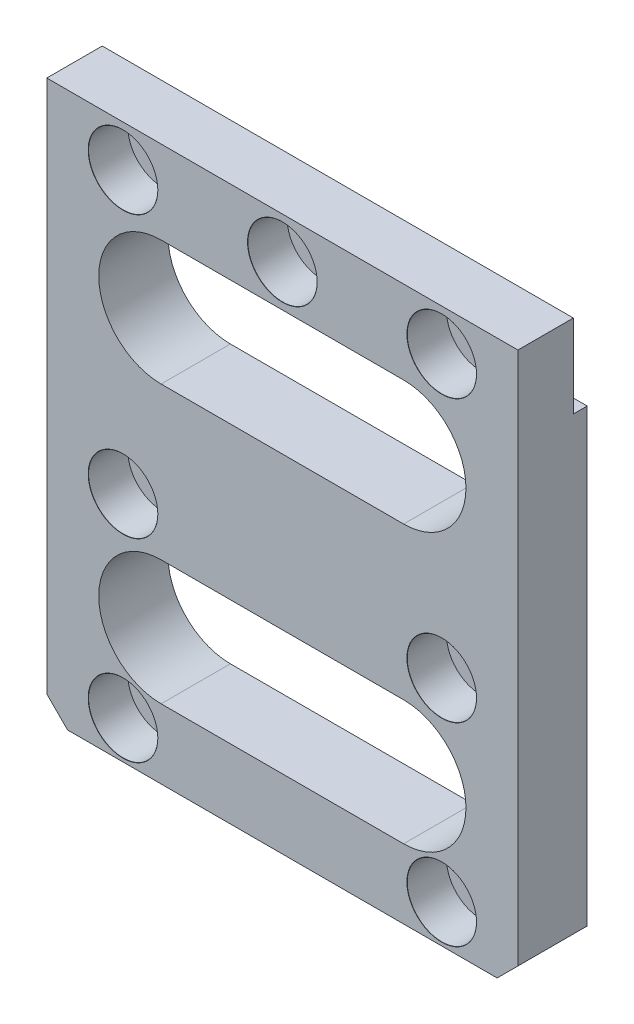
ISO-10303-21;
HEADER;
FILE_DESCRIPTION(('STEP AP214'),'2;1');
FILE_NAME('part.step','',(''),(''),'','','');
FILE_SCHEMA(('AUTOMOTIVE_DESIGN { 1 0 10303 214 1 1 1 1 }'));
ENDSEC;
DATA;
#1=APPLICATION_CONTEXT('core data for automotive mechanical design processes');
#2=APPLICATION_PROTOCOL_DEFINITION('international standard','automotive_design',2000,#1);
#3=PRODUCT_CONTEXT('',#1,'mechanical');
#4=PRODUCT('Part','Part','',(#3));
#5=PRODUCT_RELATED_PRODUCT_CATEGORY('part','',(#4));
#6=PRODUCT_DEFINITION_FORMATION('','',#4);
#7=PRODUCT_DEFINITION_CONTEXT('part definition',#1,'design');
#8=PRODUCT_DEFINITION('design','',#6,#7);
#9=PRODUCT_DEFINITION_SHAPE('','',#8);
#10=(LENGTH_UNIT() NAMED_UNIT(*) SI_UNIT(.MILLI.,.METRE.));
#11=(NAMED_UNIT(*) PLANE_ANGLE_UNIT() SI_UNIT($,.RADIAN.));
#12=(NAMED_UNIT(*) SI_UNIT($,.STERADIAN.) SOLID_ANGLE_UNIT());
#13=UNCERTAINTY_MEASURE_WITH_UNIT(LENGTH_MEASURE(1.E-05),#10,'distance_accuracy_value','');
#14=(GEOMETRIC_REPRESENTATION_CONTEXT(3) GLOBAL_UNCERTAINTY_ASSIGNED_CONTEXT((#13)) GLOBAL_UNIT_ASSIGNED_CONTEXT((#10,
#11,#12)) REPRESENTATION_CONTEXT('',''));
#15=CARTESIAN_POINT('',(0.,0.,0.));
#16=DIRECTION('',(0.,0.,1.));
#17=DIRECTION('',(1.,0.,0.));
#18=AXIS2_PLACEMENT_3D('',#15,#16,#17);
#19=CARTESIAN_POINT('',(0.,0.,10.));
#20=DIRECTION('',(0.,0.,-1.));
#21=DIRECTION('',(-1.,0.,0.));
#22=AXIS2_PLACEMENT_3D('',#19,#20,#21);
#23=PLANE('',#22);
#24=CARTESIAN_POINT('',(-26.6880278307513,-6.,10.));
#25=DIRECTION('',(0.,0.,1.));
#26=DIRECTION('',(1.,0.,0.));
#27=AXIS2_PLACEMENT_3D('',#24,#25,#26);
#28=CIRCLE('',#27,5.025);
#29=CARTESIAN_POINT('',(-21.6630278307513,-6.,10.));
#30=VERTEX_POINT('',#29);
#31=EDGE_CURVE('E420',#30,#30,#28,.T.);
#32=ORIENTED_EDGE('',*,*,#31,.F.);
#33=EDGE_LOOP('',(#32));
#34=FACE_BOUND('',#33,.T.);
#35=CARTESIAN_POINT('',(-3.68802783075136,-6.,10.));
#36=DIRECTION('',(0.,0.,1.));
#37=DIRECTION('',(1.,0.,0.));
#38=AXIS2_PLACEMENT_3D('',#35,#36,#37);
#39=CIRCLE('',#38,5.025);
#40=CARTESIAN_POINT('',(1.33697216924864,-6.,10.));
#41=VERTEX_POINT('',#40);
#42=EDGE_CURVE('E399',#41,#41,#39,.T.);
#43=ORIENTED_EDGE('',*,*,#42,.F.);
#44=EDGE_LOOP('',(#43));
#45=FACE_BOUND('',#44,.T.);
#46=CARTESIAN_POINT('',(-26.6880278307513,-74.5,10.));
#47=DIRECTION('',(0.,0.,1.));
#48=DIRECTION('',(1.,0.,0.));
#49=AXIS2_PLACEMENT_3D('',#46,#47,#48);
#50=CIRCLE('',#49,5.025);
#51=CARTESIAN_POINT('',(-21.6630278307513,-74.5,10.));
#52=VERTEX_POINT('',#51);
#53=EDGE_CURVE('E357',#52,#52,#50,.T.);
#54=ORIENTED_EDGE('',*,*,#53,.F.);
#55=EDGE_LOOP('',(#54));
#56=FACE_BOUND('',#55,.T.);
#57=CARTESIAN_POINT('',(-26.6880278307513,-46.5,10.));
#58=DIRECTION('',(0.,0.,1.));
#59=DIRECTION('',(1.,0.,0.));
#60=AXIS2_PLACEMENT_3D('',#57,#58,#59);
#61=CIRCLE('',#60,5.025);
#62=CARTESIAN_POINT('',(-21.6630278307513,-46.5,10.));
#63=VERTEX_POINT('',#62);
#64=EDGE_CURVE('E336',#63,#63,#61,.T.);
#65=ORIENTED_EDGE('',*,*,#64,.F.);
#66=EDGE_LOOP('',(#65));
#67=FACE_BOUND('',#66,.T.);
#68=CARTESIAN_POINT('',(19.3119721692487,-46.5,10.));
#69=DIRECTION('',(0.,0.,1.));
#70=DIRECTION('',(1.,0.,0.));
#71=AXIS2_PLACEMENT_3D('',#68,#69,#70);
#72=CIRCLE('',#71,5.025);
#73=CARTESIAN_POINT('',(24.3369721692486,-46.5,10.));
#74=VERTEX_POINT('',#73);
#75=EDGE_CURVE('E315',#74,#74,#72,.T.);
#76=ORIENTED_EDGE('',*,*,#75,.F.);
#77=EDGE_LOOP('',(#76));
#78=FACE_BOUND('',#77,.T.);
#79=CARTESIAN_POINT('',(19.3119721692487,-74.5,10.));
#80=DIRECTION('',(0.,0.,1.));
#81=DIRECTION('',(1.,0.,0.));
#82=AXIS2_PLACEMENT_3D('',#79,#80,#81);
#83=CIRCLE('',#82,5.025);
#84=CARTESIAN_POINT('',(24.3369721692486,-74.5,10.));
#85=VERTEX_POINT('',#84);
#86=EDGE_CURVE('E294',#85,#85,#83,.T.);
#87=ORIENTED_EDGE('',*,*,#86,.F.);
#88=EDGE_LOOP('',(#87));
#89=FACE_BOUND('',#88,.T.);
#90=CARTESIAN_POINT('',(-21.1880278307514,-21.,10.));
#91=DIRECTION('',(0.,0.,1.));
#92=DIRECTION('',(1.,0.,0.));
#93=AXIS2_PLACEMENT_3D('',#90,#91,#92);
#94=CIRCLE('',#93,9.);
#95=CARTESIAN_POINT('',(-21.1880278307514,-12.,10.));
#96=VERTEX_POINT('',#95);
#97=CARTESIAN_POINT('',(-21.1880278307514,-30.,10.));
#98=VERTEX_POINT('',#97);
#99=EDGE_CURVE('E224',#96,#98,#94,.T.);
#100=ORIENTED_EDGE('',*,*,#99,.F.);
#101=DIRECTION('',(-1.,0.,0.));
#102=VECTOR('',#101,1.);
#103=CARTESIAN_POINT('',(-21.1880278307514,-12.,10.));
#104=LINE('',#103,#102);
#105=CARTESIAN_POINT('',(13.8119721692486,-12.,10.));
#106=VERTEX_POINT('',#105);
#107=EDGE_CURVE('E232',#106,#96,#104,.T.);
#108=ORIENTED_EDGE('',*,*,#107,.F.);
#109=CARTESIAN_POINT('',(13.8119721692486,-21.,10.));
#110=DIRECTION('',(0.,0.,1.));
#111=DIRECTION('',(1.,0.,0.));
#112=AXIS2_PLACEMENT_3D('',#109,#110,#111);
#113=CIRCLE('',#112,9.);
#114=CARTESIAN_POINT('',(13.8119721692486,-30.,10.));
#115=VERTEX_POINT('',#114);
#116=EDGE_CURVE('E234',#115,#106,#113,.T.);
#117=ORIENTED_EDGE('',*,*,#116,.F.);
#118=DIRECTION('',(1.,0.,0.));
#119=VECTOR('',#118,1.);
#120=CARTESIAN_POINT('',(-21.1880278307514,-30.,10.));
#121=LINE('',#120,#119);
#122=EDGE_CURVE('E237',#98,#115,#121,.T.);
#123=ORIENTED_EDGE('',*,*,#122,.F.);
#124=EDGE_LOOP('',(#100,#108,#117,#123));
#125=FACE_BOUND('',#124,.T.);
#126=DIRECTION('',(0.,-1.,0.));
#127=VECTOR('',#126,1.);
#128=CARTESIAN_POINT('',(-37.6880278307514,0.,10.));
#129=LINE('',#128,#127);
#130=CARTESIAN_POINT('',(-37.6880278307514,0.,10.));
#131=VERTEX_POINT('',#130);
#132=CARTESIAN_POINT('',(-37.6880278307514,-77.,10.));
#133=VERTEX_POINT('',#132);
#134=EDGE_CURVE('E162',#131,#133,#129,.T.);
#135=ORIENTED_EDGE('',*,*,#134,.T.);
#136=DIRECTION('',(-0.707106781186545,0.70710678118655,0.));
#137=VECTOR('',#136,1.);
#138=CARTESIAN_POINT('',(-34.6880278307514,-80.,10.));
#139=LINE('',#138,#137);
#140=CARTESIAN_POINT('',(-34.6880278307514,-80.,10.));
#141=VERTEX_POINT('',#140);
#142=EDGE_CURVE('E24',#133,#141,#139,.F.);
#143=ORIENTED_EDGE('',*,*,#142,.T.);
#144=DIRECTION('',(1.,0.,0.));
#145=VECTOR('',#144,1.);
#146=CARTESIAN_POINT('',(30.3119721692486,-80.,10.));
#147=LINE('',#146,#145);
#148=CARTESIAN_POINT('',(27.3119721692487,-80.,10.));
#149=VERTEX_POINT('',#148);
#150=EDGE_CURVE('E163',#141,#149,#147,.T.);
#151=ORIENTED_EDGE('',*,*,#150,.T.);
#152=DIRECTION('',(-0.707106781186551,-0.707106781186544,0.));
#153=VECTOR('',#152,1.);
#154=CARTESIAN_POINT('',(30.3119721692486,-77.,10.));
#155=LINE('',#154,#153);
#156=CARTESIAN_POINT('',(30.3119721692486,-77.,10.));
#157=VERTEX_POINT('',#156);
#158=EDGE_CURVE('E31',#149,#157,#155,.F.);
#159=ORIENTED_EDGE('',*,*,#158,.T.);
#160=DIRECTION('',(0.,1.,0.));
#161=VECTOR('',#160,1.);
#162=CARTESIAN_POINT('',(30.3119721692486,0.,10.));
#163=LINE('',#162,#161);
#164=CARTESIAN_POINT('',(30.3119721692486,0.,10.));
#165=VERTEX_POINT('',#164);
#166=EDGE_CURVE('E201',#157,#165,#163,.T.);
#167=ORIENTED_EDGE('',*,*,#166,.T.);
#168=DIRECTION('',(-1.,0.,0.));
#169=VECTOR('',#168,1.);
#170=CARTESIAN_POINT('',(30.3119721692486,0.,10.));
#171=LINE('',#170,#169);
#172=EDGE_CURVE('E206',#165,#131,#171,.T.);
#173=ORIENTED_EDGE('',*,*,#172,.T.);
#174=EDGE_LOOP('',(#135,#143,#151,#159,#167,#173));
#175=FACE_BOUND('',#174,.T.);
#176=CARTESIAN_POINT('',(-21.1880278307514,-60.9748393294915,10.));
#177=DIRECTION('',(0.,0.,1.));
#178=DIRECTION('',(1.,0.,0.));
#179=AXIS2_PLACEMENT_3D('',#176,#177,#178);
#180=CIRCLE('',#179,9.);
#181=CARTESIAN_POINT('',(-21.1880278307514,-51.9748393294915,10.));
#182=VERTEX_POINT('',#181);
#183=CARTESIAN_POINT('',(-21.1880278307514,-69.9748393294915,10.));
#184=VERTEX_POINT('',#183);
#185=EDGE_CURVE('E253',#182,#184,#180,.T.);
#186=ORIENTED_EDGE('',*,*,#185,.F.);
#187=DIRECTION('',(-1.,0.,0.));
#188=VECTOR('',#187,1.);
#189=CARTESIAN_POINT('',(-21.1880278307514,-51.9748393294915,10.));
#190=LINE('',#189,#188);
#191=CARTESIAN_POINT('',(13.8119721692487,-51.9748393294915,10.));
#192=VERTEX_POINT('',#191);
#193=EDGE_CURVE('E249',#192,#182,#190,.T.);
#194=ORIENTED_EDGE('',*,*,#193,.F.);
#195=CARTESIAN_POINT('',(13.8119721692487,-60.9748393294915,10.));
#196=DIRECTION('',(0.,0.,1.));
#197=DIRECTION('',(1.,0.,0.));
#198=AXIS2_PLACEMENT_3D('',#195,#196,#197);
#199=CIRCLE('',#198,9.);
#200=CARTESIAN_POINT('',(13.8119721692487,-69.9748393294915,10.));
#201=VERTEX_POINT('',#200);
#202=EDGE_CURVE('E265',#201,#192,#199,.T.);
#203=ORIENTED_EDGE('',*,*,#202,.F.);
#204=DIRECTION('',(1.,0.,0.));
#205=VECTOR('',#204,1.);
#206=CARTESIAN_POINT('',(-21.1880278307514,-69.9748393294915,10.));
#207=LINE('',#206,#205);
#208=EDGE_CURVE('E268',#184,#201,#207,.T.);
#209=ORIENTED_EDGE('',*,*,#208,.F.);
#210=EDGE_LOOP('',(#186,#194,#203,#209));
#211=FACE_BOUND('',#210,.T.);
#212=CARTESIAN_POINT('',(19.3119721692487,-6.,10.));
#213=DIRECTION('',(0.,0.,1.));
#214=DIRECTION('',(1.,0.,0.));
#215=AXIS2_PLACEMENT_3D('',#212,#213,#214);
#216=CIRCLE('',#215,5.025);
#217=CARTESIAN_POINT('',(24.3369721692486,-6.,10.));
#218=VERTEX_POINT('',#217);
#219=EDGE_CURVE('E378',#218,#218,#216,.T.);
#220=ORIENTED_EDGE('',*,*,#219,.F.);
#221=EDGE_LOOP('',(#220));
#222=FACE_BOUND('',#221,.T.);
#223=ADVANCED_FACE('F16',(#34,#45,#56,#67,#78,#89,#125,#175,#211,#222),#23,.F.);
#224=CARTESIAN_POINT('',(0.,0.,0.));
#225=DIRECTION('',(0.,0.,-1.));
#226=DIRECTION('',(-1.,0.,0.));
#227=AXIS2_PLACEMENT_3D('',#224,#225,#226);
#228=PLANE('',#227);
#229=CARTESIAN_POINT('',(-26.6880278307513,-74.5,0.));
#230=DIRECTION('',(0.,0.,1.));
#231=DIRECTION('',(1.,0.,0.));
#232=AXIS2_PLACEMENT_3D('',#229,#230,#231);
#233=CIRCLE('',#232,2.775);
#234=CARTESIAN_POINT('',(-23.9130278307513,-74.5,0.));
#235=VERTEX_POINT('',#234);
#236=EDGE_CURVE('E360',#235,#235,#233,.T.);
#237=ORIENTED_EDGE('',*,*,#236,.T.);
#238=EDGE_LOOP('',(#237));
#239=FACE_BOUND('',#238,.T.);
#240=CARTESIAN_POINT('',(-26.6880278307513,-46.5,0.));
#241=DIRECTION('',(0.,0.,1.));
#242=DIRECTION('',(1.,0.,0.));
#243=AXIS2_PLACEMENT_3D('',#240,#241,#242);
#244=CIRCLE('',#243,2.775);
#245=CARTESIAN_POINT('',(-23.9130278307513,-46.5,0.));
#246=VERTEX_POINT('',#245);
#247=EDGE_CURVE('E339',#246,#246,#244,.T.);
#248=ORIENTED_EDGE('',*,*,#247,.T.);
#249=EDGE_LOOP('',(#248));
#250=FACE_BOUND('',#249,.T.);
#251=CARTESIAN_POINT('',(19.3119721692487,-46.5,0.));
#252=DIRECTION('',(0.,0.,1.));
#253=DIRECTION('',(1.,0.,0.));
#254=AXIS2_PLACEMENT_3D('',#251,#252,#253);
#255=CIRCLE('',#254,2.775);
#256=CARTESIAN_POINT('',(22.0869721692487,-46.5,0.));
#257=VERTEX_POINT('',#256);
#258=EDGE_CURVE('E318',#257,#257,#255,.T.);
#259=ORIENTED_EDGE('',*,*,#258,.T.);
#260=EDGE_LOOP('',(#259));
#261=FACE_BOUND('',#260,.T.);
#262=CARTESIAN_POINT('',(19.3119721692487,-74.5,0.));
#263=DIRECTION('',(0.,0.,1.));
#264=DIRECTION('',(1.,0.,0.));
#265=AXIS2_PLACEMENT_3D('',#262,#263,#264);
#266=CIRCLE('',#265,2.775);
#267=CARTESIAN_POINT('',(22.0869721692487,-74.5,0.));
#268=VERTEX_POINT('',#267);
#269=EDGE_CURVE('E297',#268,#268,#266,.T.);
#270=ORIENTED_EDGE('',*,*,#269,.T.);
#271=EDGE_LOOP('',(#270));
#272=FACE_BOUND('',#271,.T.);
#273=DIRECTION('',(1.,0.,0.));
#274=VECTOR('',#273,1.);
#275=CARTESIAN_POINT('',(30.3119721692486,-80.,0.));
#276=LINE('',#275,#274);
#277=CARTESIAN_POINT('',(-34.6880278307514,-80.,0.));
#278=VERTEX_POINT('',#277);
#279=CARTESIAN_POINT('',(27.3119721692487,-80.,0.));
#280=VERTEX_POINT('',#279);
#281=EDGE_CURVE('E169',#278,#280,#276,.T.);
#282=ORIENTED_EDGE('',*,*,#281,.F.);
#283=DIRECTION('',(0.707106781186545,-0.70710678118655,0.));
#284=VECTOR('',#283,1.);
#285=CARTESIAN_POINT('',(-57.3440139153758,-57.3440139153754,0.));
#286=LINE('',#285,#284);
#287=CARTESIAN_POINT('',(-37.6880278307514,-77.,0.));
#288=VERTEX_POINT('',#287);
#289=EDGE_CURVE('E180',#278,#288,#286,.F.);
#290=ORIENTED_EDGE('',*,*,#289,.T.);
#291=DIRECTION('',(0.,-1.,0.));
#292=VECTOR('',#291,1.);
#293=CARTESIAN_POINT('',(-37.6880278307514,0.,0.));
#294=LINE('',#293,#292);
#295=CARTESIAN_POINT('',(-37.6880278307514,-12.,0.));
#296=VERTEX_POINT('',#295);
#297=EDGE_CURVE('E199',#296,#288,#294,.T.);
#298=ORIENTED_EDGE('',*,*,#297,.F.);
#299=DIRECTION('',(1.,0.,0.));
#300=VECTOR('',#299,1.);
#301=CARTESIAN_POINT('',(-37.6880278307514,-12.,0.));
#302=LINE('',#301,#300);
#303=CARTESIAN_POINT('',(-21.1880278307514,-12.,0.));
#304=VERTEX_POINT('',#303);
#305=EDGE_CURVE('E263',#296,#304,#302,.T.);
#306=ORIENTED_EDGE('',*,*,#305,.T.);
#307=CARTESIAN_POINT('',(-21.1880278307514,-21.,0.));
#308=DIRECTION('',(0.,0.,1.));
#309=DIRECTION('',(1.,0.,0.));
#310=AXIS2_PLACEMENT_3D('',#307,#308,#309);
#311=CIRCLE('',#310,9.);
#312=CARTESIAN_POINT('',(-21.1880278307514,-30.,0.));
#313=VERTEX_POINT('',#312);
#314=EDGE_CURVE('E228',#304,#313,#311,.T.);
#315=ORIENTED_EDGE('',*,*,#314,.T.);
#316=DIRECTION('',(1.,0.,0.));
#317=VECTOR('',#316,1.);
#318=CARTESIAN_POINT('',(-21.1880278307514,-30.,0.));
#319=LINE('',#318,#317);
#320=CARTESIAN_POINT('',(13.8119721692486,-30.,0.));
#321=VERTEX_POINT('',#320);
#322=EDGE_CURVE('E225',#313,#321,#319,.T.);
#323=ORIENTED_EDGE('',*,*,#322,.T.);
#324=CARTESIAN_POINT('',(13.8119721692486,-21.,0.));
#325=DIRECTION('',(0.,0.,1.));
#326=DIRECTION('',(1.,0.,0.));
#327=AXIS2_PLACEMENT_3D('',#324,#325,#326);
#328=CIRCLE('',#327,9.);
#329=CARTESIAN_POINT('',(13.8119721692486,-12.,0.));
#330=VERTEX_POINT('',#329);
#331=EDGE_CURVE('E221',#321,#330,#328,.T.);
#332=ORIENTED_EDGE('',*,*,#331,.T.);
#333=CARTESIAN_POINT('',(30.3119721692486,-12.,0.));
#334=VERTEX_POINT('',#333);
#335=EDGE_CURVE('E272',#330,#334,#302,.T.);
#336=ORIENTED_EDGE('',*,*,#335,.T.);
#337=DIRECTION('',(0.,1.,0.));
#338=VECTOR('',#337,1.);
#339=CARTESIAN_POINT('',(30.3119721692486,0.,0.));
#340=LINE('',#339,#338);
#341=CARTESIAN_POINT('',(30.3119721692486,-77.,0.));
#342=VERTEX_POINT('',#341);
#343=EDGE_CURVE('E200',#342,#334,#340,.T.);
#344=ORIENTED_EDGE('',*,*,#343,.F.);
#345=DIRECTION('',(0.707106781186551,0.707106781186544,0.));
#346=VECTOR('',#345,1.);
#347=CARTESIAN_POINT('',(53.6559860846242,-53.6559860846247,0.));
#348=LINE('',#347,#346);
#349=EDGE_CURVE('E178',#342,#280,#348,.F.);
#350=ORIENTED_EDGE('',*,*,#349,.T.);
#351=EDGE_LOOP('',(#282,#290,#298,#306,#315,#323,#332,#336,#344,#350));
#352=FACE_BOUND('',#351,.T.);
#353=DIRECTION('',(-1.,0.,0.));
#354=VECTOR('',#353,1.);
#355=CARTESIAN_POINT('',(-21.1880278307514,-51.9748393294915,0.));
#356=LINE('',#355,#354);
#357=CARTESIAN_POINT('',(13.8119721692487,-51.9748393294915,0.));
#358=VERTEX_POINT('',#357);
#359=CARTESIAN_POINT('',(-21.1880278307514,-51.9748393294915,0.));
#360=VERTEX_POINT('',#359);
#361=EDGE_CURVE('E250',#358,#360,#356,.T.);
#362=ORIENTED_EDGE('',*,*,#361,.T.);
#363=CARTESIAN_POINT('',(-21.1880278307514,-60.9748393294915,0.));
#364=DIRECTION('',(0.,0.,1.));
#365=DIRECTION('',(1.,0.,0.));
#366=AXIS2_PLACEMENT_3D('',#363,#364,#365);
#367=CIRCLE('',#366,9.);
#368=CARTESIAN_POINT('',(-21.1880278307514,-69.9748393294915,0.));
#369=VERTEX_POINT('',#368);
#370=EDGE_CURVE('E260',#360,#369,#367,.T.);
#371=ORIENTED_EDGE('',*,*,#370,.T.);
#372=DIRECTION('',(1.,0.,0.));
#373=VECTOR('',#372,1.);
#374=CARTESIAN_POINT('',(-21.1880278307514,-69.9748393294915,0.));
#375=LINE('',#374,#373);
#376=CARTESIAN_POINT('',(13.8119721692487,-69.9748393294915,0.));
#377=VERTEX_POINT('',#376);
#378=EDGE_CURVE('E257',#369,#377,#375,.T.);
#379=ORIENTED_EDGE('',*,*,#378,.T.);
#380=CARTESIAN_POINT('',(13.8119721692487,-60.9748393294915,0.));
#381=DIRECTION('',(0.,0.,1.));
#382=DIRECTION('',(1.,0.,0.));
#383=AXIS2_PLACEMENT_3D('',#380,#381,#382);
#384=CIRCLE('',#383,9.);
#385=EDGE_CURVE('E254',#377,#358,#384,.T.);
#386=ORIENTED_EDGE('',*,*,#385,.T.);
#387=EDGE_LOOP('',(#362,#371,#379,#386));
#388=FACE_BOUND('',#387,.T.);
#389=ADVANCED_FACE('F196',(#239,#250,#261,#272,#352,#388),#228,.T.);
#390=CARTESIAN_POINT('',(30.3119721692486,0.,10.));
#391=DIRECTION('',(-1.,0.,0.));
#392=DIRECTION('',(0.,-1.,0.));
#393=AXIS2_PLACEMENT_3D('',#390,#391,#392);
#394=PLANE('',#393);
#395=ORIENTED_EDGE('',*,*,#166,.F.);
#396=DIRECTION('',(0.,0.,-1.));
#397=VECTOR('',#396,1.);
#398=CARTESIAN_POINT('',(30.3119721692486,-77.,10.));
#399=LINE('',#398,#397);
#400=EDGE_CURVE('E11',#157,#342,#399,.T.);
#401=ORIENTED_EDGE('',*,*,#400,.T.);
#402=ORIENTED_EDGE('',*,*,#343,.T.);
#403=DIRECTION('',(0.,0.,-1.));
#404=VECTOR('',#403,1.);
#405=CARTESIAN_POINT('',(30.3119721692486,-12.,0.));
#406=LINE('',#405,#404);
#407=CARTESIAN_POINT('',(30.3119721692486,-12.,2.));
#408=VERTEX_POINT('',#407);
#409=EDGE_CURVE('E149',#408,#334,#406,.T.);
#410=ORIENTED_EDGE('',*,*,#409,.F.);
#411=DIRECTION('',(0.,-1.,0.));
#412=VECTOR('',#411,1.);
#413=CARTESIAN_POINT('',(30.3119721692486,0.,2.));
#414=LINE('',#413,#412);
#415=CARTESIAN_POINT('',(30.3119721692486,0.,2.));
#416=VERTEX_POINT('',#415);
#417=EDGE_CURVE('E276',#416,#408,#414,.T.);
#418=ORIENTED_EDGE('',*,*,#417,.F.);
#419=DIRECTION('',(0.,0.,-1.));
#420=VECTOR('',#419,1.);
#421=CARTESIAN_POINT('',(30.3119721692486,0.,10.));
#422=LINE('',#421,#420);
#423=EDGE_CURVE('E158',#165,#416,#422,.T.);
#424=ORIENTED_EDGE('',*,*,#423,.F.);
#425=EDGE_LOOP('',(#395,#401,#402,#410,#418,#424));
#426=FACE_BOUND('',#425,.T.);
#427=ADVANCED_FACE('F507',(#426),#394,.F.);
#428=CARTESIAN_POINT('',(30.3119721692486,0.,10.));
#429=DIRECTION('',(0.,-1.,0.));
#430=DIRECTION('',(1.,0.,0.));
#431=AXIS2_PLACEMENT_3D('',#428,#429,#430);
#432=PLANE('',#431);
#433=ORIENTED_EDGE('',*,*,#423,.T.);
#434=DIRECTION('',(1.,0.,0.));
#435=VECTOR('',#434,1.);
#436=CARTESIAN_POINT('',(-37.6880278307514,0.,2.));
#437=LINE('',#436,#435);
#438=CARTESIAN_POINT('',(-37.6880278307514,0.,2.));
#439=VERTEX_POINT('',#438);
#440=EDGE_CURVE('E141',#439,#416,#437,.T.);
#441=ORIENTED_EDGE('',*,*,#440,.F.);
#442=DIRECTION('',(0.,0.,-1.));
#443=VECTOR('',#442,1.);
#444=CARTESIAN_POINT('',(-37.6880278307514,0.,10.));
#445=LINE('',#444,#443);
#446=EDGE_CURVE('E156',#131,#439,#445,.T.);
#447=ORIENTED_EDGE('',*,*,#446,.F.);
#448=ORIENTED_EDGE('',*,*,#172,.F.);
#449=EDGE_LOOP('',(#433,#441,#447,#448));
#450=FACE_BOUND('',#449,.T.);
#451=ADVANCED_FACE('F154',(#450),#432,.F.);
#452=CARTESIAN_POINT('',(-37.6880278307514,0.,10.));
#453=DIRECTION('',(1.,0.,0.));
#454=DIRECTION('',(0.,1.,0.));
#455=AXIS2_PLACEMENT_3D('',#452,#453,#454);
#456=PLANE('',#455);
#457=ORIENTED_EDGE('',*,*,#297,.T.);
#458=DIRECTION('',(0.,0.,1.));
#459=VECTOR('',#458,1.);
#460=CARTESIAN_POINT('',(-37.6880278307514,-77.,10.));
#461=LINE('',#460,#459);
#462=EDGE_CURVE('E39',#288,#133,#461,.T.);
#463=ORIENTED_EDGE('',*,*,#462,.T.);
#464=ORIENTED_EDGE('',*,*,#134,.F.);
#465=ORIENTED_EDGE('',*,*,#446,.T.);
#466=DIRECTION('',(0.,-1.,0.));
#467=VECTOR('',#466,1.);
#468=CARTESIAN_POINT('',(-37.6880278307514,0.,2.));
#469=LINE('',#468,#467);
#470=CARTESIAN_POINT('',(-37.6880278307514,-12.,2.));
#471=VERTEX_POINT('',#470);
#472=EDGE_CURVE('E137',#439,#471,#469,.T.);
#473=ORIENTED_EDGE('',*,*,#472,.T.);
#474=DIRECTION('',(0.,0.,-1.));
#475=VECTOR('',#474,1.);
#476=CARTESIAN_POINT('',(-37.6880278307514,-12.,0.));
#477=LINE('',#476,#475);
#478=EDGE_CURVE('E148',#471,#296,#477,.T.);
#479=ORIENTED_EDGE('',*,*,#478,.T.);
#480=EDGE_LOOP('',(#457,#463,#464,#465,#473,#479));
#481=FACE_BOUND('',#480,.T.);
#482=ADVANCED_FACE('F161',(#481),#456,.F.);
#483=CARTESIAN_POINT('',(30.3119721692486,-80.,10.));
#484=DIRECTION('',(0.,1.,0.));
#485=DIRECTION('',(-1.,0.,0.));
#486=AXIS2_PLACEMENT_3D('',#483,#484,#485);
#487=PLANE('',#486);
#488=ORIENTED_EDGE('',*,*,#150,.F.);
#489=DIRECTION('',(0.,0.,-1.));
#490=VECTOR('',#489,1.);
#491=CARTESIAN_POINT('',(-34.6880278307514,-80.,10.));
#492=LINE('',#491,#490);
#493=EDGE_CURVE('E175',#141,#278,#492,.T.);
#494=ORIENTED_EDGE('',*,*,#493,.T.);
#495=ORIENTED_EDGE('',*,*,#281,.T.);
#496=DIRECTION('',(0.,0.,1.));
#497=VECTOR('',#496,1.);
#498=CARTESIAN_POINT('',(27.3119721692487,-80.,10.));
#499=LINE('',#498,#497);
#500=EDGE_CURVE('E173',#280,#149,#499,.T.);
#501=ORIENTED_EDGE('',*,*,#500,.T.);
#502=EDGE_LOOP('',(#488,#494,#495,#501));
#503=FACE_BOUND('',#502,.T.);
#504=ADVANCED_FACE('F189',(#503),#487,.F.);
#505=CARTESIAN_POINT('',(-21.1880278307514,-21.,10.));
#506=DIRECTION('',(0.,0.,-1.));
#507=DIRECTION('',(-1.,0.,0.));
#508=AXIS2_PLACEMENT_3D('',#505,#506,#507);
#509=CYLINDRICAL_SURFACE('',#508,9.);
#510=ORIENTED_EDGE('',*,*,#314,.F.);
#511=DIRECTION('',(0.,0.,-1.));
#512=VECTOR('',#511,1.);
#513=CARTESIAN_POINT('',(-21.1880278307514,-12.,10.));
#514=LINE('',#513,#512);
#515=CARTESIAN_POINT('',(-21.1880278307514,-12.,2.));
#516=VERTEX_POINT('',#515);
#517=EDGE_CURVE('E220',#516,#304,#514,.T.);
#518=ORIENTED_EDGE('',*,*,#517,.F.);
#519=EDGE_CURVE('E217',#96,#516,#514,.T.);
#520=ORIENTED_EDGE('',*,*,#519,.F.);
#521=ORIENTED_EDGE('',*,*,#99,.T.);
#522=DIRECTION('',(0.,0.,-1.));
#523=VECTOR('',#522,1.);
#524=CARTESIAN_POINT('',(-21.1880278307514,-30.,10.));
#525=LINE('',#524,#523);
#526=EDGE_CURVE('E202',#98,#313,#525,.T.);
#527=ORIENTED_EDGE('',*,*,#526,.T.);
#528=EDGE_LOOP('',(#510,#518,#520,#521,#527));
#529=FACE_BOUND('',#528,.T.);
#530=ADVANCED_FACE('F487',(#529),#509,.F.);
#531=CARTESIAN_POINT('',(-21.1880278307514,-30.,10.));
#532=DIRECTION('',(0.,1.,0.));
#533=DIRECTION('',(-1.,0.,0.));
#534=AXIS2_PLACEMENT_3D('',#531,#532,#533);
#535=PLANE('',#534);
#536=ORIENTED_EDGE('',*,*,#322,.F.);
#537=ORIENTED_EDGE('',*,*,#526,.F.);
#538=ORIENTED_EDGE('',*,*,#122,.T.);
#539=DIRECTION('',(0.,0.,-1.));
#540=VECTOR('',#539,1.);
#541=CARTESIAN_POINT('',(13.8119721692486,-30.,10.));
#542=LINE('',#541,#540);
#543=EDGE_CURVE('E211',#115,#321,#542,.T.);
#544=ORIENTED_EDGE('',*,*,#543,.T.);
#545=EDGE_LOOP('',(#536,#537,#538,#544));
#546=FACE_BOUND('',#545,.T.);
#547=ADVANCED_FACE('F490',(#546),#535,.T.);
#548=CARTESIAN_POINT('',(13.8119721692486,-21.,10.));
#549=DIRECTION('',(0.,0.,-1.));
#550=DIRECTION('',(-1.,0.,0.));
#551=AXIS2_PLACEMENT_3D('',#548,#549,#550);
#552=CYLINDRICAL_SURFACE('',#551,9.);
#553=ORIENTED_EDGE('',*,*,#331,.F.);
#554=ORIENTED_EDGE('',*,*,#543,.F.);
#555=ORIENTED_EDGE('',*,*,#116,.T.);
#556=DIRECTION('',(0.,0.,-1.));
#557=VECTOR('',#556,1.);
#558=CARTESIAN_POINT('',(13.8119721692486,-12.,10.));
#559=LINE('',#558,#557);
#560=CARTESIAN_POINT('',(13.8119721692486,-12.,2.));
#561=VERTEX_POINT('',#560);
#562=EDGE_CURVE('E213',#106,#561,#559,.T.);
#563=ORIENTED_EDGE('',*,*,#562,.T.);
#564=EDGE_CURVE('E216',#561,#330,#559,.T.);
#565=ORIENTED_EDGE('',*,*,#564,.T.);
#566=EDGE_LOOP('',(#553,#554,#555,#563,#565));
#567=FACE_BOUND('',#566,.T.);
#568=ADVANCED_FACE('F500',(#567),#552,.F.);
#569=CARTESIAN_POINT('',(-21.1880278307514,-12.,10.));
#570=DIRECTION('',(0.,-1.,0.));
#571=DIRECTION('',(1.,0.,0.));
#572=AXIS2_PLACEMENT_3D('',#569,#570,#571);
#573=PLANE('',#572);
#574=DIRECTION('',(-1.,0.,0.));
#575=VECTOR('',#574,1.);
#576=CARTESIAN_POINT('',(-21.1880278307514,-12.,2.));
#577=LINE('',#576,#575);
#578=EDGE_CURVE('E165',#561,#516,#577,.T.);
#579=ORIENTED_EDGE('',*,*,#578,.F.);
#580=ORIENTED_EDGE('',*,*,#562,.F.);
#581=ORIENTED_EDGE('',*,*,#107,.T.);
#582=ORIENTED_EDGE('',*,*,#519,.T.);
#583=EDGE_LOOP('',(#579,#580,#581,#582));
#584=FACE_BOUND('',#583,.T.);
#585=ADVANCED_FACE('F497',(#584),#573,.T.);
#586=CARTESIAN_POINT('',(-21.1880278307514,-60.9748393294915,10.));
#587=DIRECTION('',(0.,0.,-1.));
#588=DIRECTION('',(-1.,0.,0.));
#589=AXIS2_PLACEMENT_3D('',#586,#587,#588);
#590=CYLINDRICAL_SURFACE('',#589,9.);
#591=ORIENTED_EDGE('',*,*,#370,.F.);
#592=DIRECTION('',(0.,0.,-1.));
#593=VECTOR('',#592,1.);
#594=CARTESIAN_POINT('',(-21.1880278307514,-51.9748393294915,10.));
#595=LINE('',#594,#593);
#596=EDGE_CURVE('E246',#182,#360,#595,.T.);
#597=ORIENTED_EDGE('',*,*,#596,.F.);
#598=ORIENTED_EDGE('',*,*,#185,.T.);
#599=DIRECTION('',(0.,0.,-1.));
#600=VECTOR('',#599,1.);
#601=CARTESIAN_POINT('',(-21.1880278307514,-69.9748393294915,10.));
#602=LINE('',#601,#600);
#603=EDGE_CURVE('E231',#184,#369,#602,.T.);
#604=ORIENTED_EDGE('',*,*,#603,.T.);
#605=EDGE_LOOP('',(#591,#597,#598,#604));
#606=FACE_BOUND('',#605,.T.);
#607=ADVANCED_FACE('F547',(#606),#590,.F.);
#608=CARTESIAN_POINT('',(-21.1880278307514,-69.9748393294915,10.));
#609=DIRECTION('',(0.,1.,0.));
#610=DIRECTION('',(0.,0.,1.));
#611=AXIS2_PLACEMENT_3D('',#608,#609,#610);
#612=PLANE('',#611);
#613=ORIENTED_EDGE('',*,*,#378,.F.);
#614=ORIENTED_EDGE('',*,*,#603,.F.);
#615=ORIENTED_EDGE('',*,*,#208,.T.);
#616=DIRECTION('',(0.,0.,-1.));
#617=VECTOR('',#616,1.);
#618=CARTESIAN_POINT('',(13.8119721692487,-69.9748393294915,10.));
#619=LINE('',#618,#617);
#620=EDGE_CURVE('E242',#201,#377,#619,.T.);
#621=ORIENTED_EDGE('',*,*,#620,.T.);
#622=EDGE_LOOP('',(#613,#614,#615,#621));
#623=FACE_BOUND('',#622,.T.);
#624=ADVANCED_FACE('F550',(#623),#612,.T.);
#625=CARTESIAN_POINT('',(13.8119721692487,-60.9748393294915,10.));
#626=DIRECTION('',(0.,0.,-1.));
#627=DIRECTION('',(-1.,0.,0.));
#628=AXIS2_PLACEMENT_3D('',#625,#626,#627);
#629=CYLINDRICAL_SURFACE('',#628,9.);
#630=ORIENTED_EDGE('',*,*,#385,.F.);
#631=ORIENTED_EDGE('',*,*,#620,.F.);
#632=ORIENTED_EDGE('',*,*,#202,.T.);
#633=DIRECTION('',(0.,0.,-1.));
#634=VECTOR('',#633,1.);
#635=CARTESIAN_POINT('',(13.8119721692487,-51.9748393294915,10.));
#636=LINE('',#635,#634);
#637=EDGE_CURVE('E244',#192,#358,#636,.T.);
#638=ORIENTED_EDGE('',*,*,#637,.T.);
#639=EDGE_LOOP('',(#630,#631,#632,#638));
#640=FACE_BOUND('',#639,.T.);
#641=ADVANCED_FACE('F554',(#640),#629,.F.);
#642=CARTESIAN_POINT('',(-21.1880278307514,-51.9748393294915,10.));
#643=DIRECTION('',(0.,-1.,0.));
#644=DIRECTION('',(1.,0.,0.));
#645=AXIS2_PLACEMENT_3D('',#642,#643,#644);
#646=PLANE('',#645);
#647=ORIENTED_EDGE('',*,*,#361,.F.);
#648=ORIENTED_EDGE('',*,*,#637,.F.);
#649=ORIENTED_EDGE('',*,*,#193,.T.);
#650=ORIENTED_EDGE('',*,*,#596,.T.);
#651=EDGE_LOOP('',(#647,#648,#649,#650));
#652=FACE_BOUND('',#651,.T.);
#653=ADVANCED_FACE('F558',(#652),#646,.T.);
#654=CARTESIAN_POINT('',(-37.6880278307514,-12.,0.));
#655=DIRECTION('',(0.,-1.,0.));
#656=DIRECTION('',(1.,0.,0.));
#657=AXIS2_PLACEMENT_3D('',#654,#655,#656);
#658=PLANE('',#657);
#659=DIRECTION('',(1.,0.,0.));
#660=VECTOR('',#659,1.);
#661=CARTESIAN_POINT('',(-37.6880278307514,-12.,2.));
#662=LINE('',#661,#660);
#663=EDGE_CURVE('E159',#561,#408,#662,.T.);
#664=ORIENTED_EDGE('',*,*,#663,.T.);
#665=ORIENTED_EDGE('',*,*,#409,.T.);
#666=ORIENTED_EDGE('',*,*,#335,.F.);
#667=ORIENTED_EDGE('',*,*,#564,.F.);
#668=EDGE_LOOP('',(#664,#665,#666,#667));
#669=FACE_BOUND('',#668,.T.);
#670=ADVANCED_FACE('F503',(#669),#658,.F.);
#671=ORIENTED_EDGE('',*,*,#517,.T.);
#672=ORIENTED_EDGE('',*,*,#305,.F.);
#673=ORIENTED_EDGE('',*,*,#478,.F.);
#674=EDGE_CURVE('E144',#471,#516,#662,.T.);
#675=ORIENTED_EDGE('',*,*,#674,.T.);
#676=EDGE_LOOP('',(#671,#672,#673,#675));
#677=FACE_BOUND('',#676,.T.);
#678=ADVANCED_FACE('F525',(#677),#658,.F.);
#679=CARTESIAN_POINT('',(-37.6880278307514,0.,2.));
#680=DIRECTION('',(0.,0.,1.));
#681=DIRECTION('',(0.,-1.,0.));
#682=AXIS2_PLACEMENT_3D('',#679,#680,#681);
#683=PLANE('',#682);
#684=CARTESIAN_POINT('',(-26.6880278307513,-6.,2.));
#685=DIRECTION('',(0.,0.,1.));
#686=DIRECTION('',(1.,0.,0.));
#687=AXIS2_PLACEMENT_3D('',#684,#685,#686);
#688=CIRCLE('',#687,2.775);
#689=CARTESIAN_POINT('',(-23.9130278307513,-6.,2.));
#690=VERTEX_POINT('',#689);
#691=EDGE_CURVE('E423',#690,#690,#688,.T.);
#692=ORIENTED_EDGE('',*,*,#691,.T.);
#693=EDGE_LOOP('',(#692));
#694=FACE_BOUND('',#693,.T.);
#695=CARTESIAN_POINT('',(-3.68802783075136,-6.,2.));
#696=DIRECTION('',(0.,0.,1.));
#697=DIRECTION('',(1.,0.,0.));
#698=AXIS2_PLACEMENT_3D('',#695,#696,#697);
#699=CIRCLE('',#698,2.775);
#700=CARTESIAN_POINT('',(-0.91302783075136,-6.,2.));
#701=VERTEX_POINT('',#700);
#702=EDGE_CURVE('E402',#701,#701,#699,.T.);
#703=ORIENTED_EDGE('',*,*,#702,.T.);
#704=EDGE_LOOP('',(#703));
#705=FACE_BOUND('',#704,.T.);
#706=CARTESIAN_POINT('',(19.3119721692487,-6.,2.));
#707=DIRECTION('',(0.,0.,1.));
#708=DIRECTION('',(1.,0.,0.));
#709=AXIS2_PLACEMENT_3D('',#706,#707,#708);
#710=CIRCLE('',#709,2.775);
#711=CARTESIAN_POINT('',(22.0869721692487,-6.,2.));
#712=VERTEX_POINT('',#711);
#713=EDGE_CURVE('E381',#712,#712,#710,.T.);
#714=ORIENTED_EDGE('',*,*,#713,.T.);
#715=EDGE_LOOP('',(#714));
#716=FACE_BOUND('',#715,.T.);
#717=ORIENTED_EDGE('',*,*,#417,.T.);
#718=ORIENTED_EDGE('',*,*,#663,.F.);
#719=ORIENTED_EDGE('',*,*,#578,.T.);
#720=ORIENTED_EDGE('',*,*,#674,.F.);
#721=ORIENTED_EDGE('',*,*,#472,.F.);
#722=ORIENTED_EDGE('',*,*,#440,.T.);
#723=EDGE_LOOP('',(#717,#718,#719,#720,#721,#722));
#724=FACE_BOUND('',#723,.T.);
#725=ADVANCED_FACE('F140',(#694,#705,#716,#724),#683,.F.);
#726=CARTESIAN_POINT('',(-34.6880278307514,-80.,10.));
#727=DIRECTION('',(0.70710678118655,0.707106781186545,0.));
#728=DIRECTION('',(0.,0.,-1.));
#729=AXIS2_PLACEMENT_3D('',#726,#727,#728);
#730=PLANE('',#729);
#731=ORIENTED_EDGE('',*,*,#142,.F.);
#732=ORIENTED_EDGE('',*,*,#462,.F.);
#733=ORIENTED_EDGE('',*,*,#289,.F.);
#734=ORIENTED_EDGE('',*,*,#493,.F.);
#735=EDGE_LOOP('',(#731,#732,#733,#734));
#736=FACE_BOUND('',#735,.T.);
#737=ADVANCED_FACE('F193',(#736),#730,.F.);
#738=CARTESIAN_POINT('',(30.3119721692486,-77.,10.));
#739=DIRECTION('',(-0.707106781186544,0.707106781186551,0.));
#740=DIRECTION('',(0.,0.,-1.));
#741=AXIS2_PLACEMENT_3D('',#738,#739,#740);
#742=PLANE('',#741);
#743=ORIENTED_EDGE('',*,*,#158,.F.);
#744=ORIENTED_EDGE('',*,*,#500,.F.);
#745=ORIENTED_EDGE('',*,*,#349,.F.);
#746=ORIENTED_EDGE('',*,*,#400,.F.);
#747=EDGE_LOOP('',(#743,#744,#745,#746));
#748=FACE_BOUND('',#747,.T.);
#749=ADVANCED_FACE('F18',(#748),#742,.F.);
#750=CARTESIAN_POINT('',(19.3119721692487,-74.5,0.0250000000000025));
#751=DIRECTION('',(0.,0.,-1.));
#752=DIRECTION('',(-1.,0.,0.));
#753=AXIS2_PLACEMENT_3D('',#750,#751,#752);
#754=CONICAL_SURFACE('',#753,2.75,0.785398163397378);
#755=ORIENTED_EDGE('',*,*,#269,.F.);
#756=EDGE_LOOP('',(#755));
#757=FACE_BOUND('',#756,.T.);
#758=CARTESIAN_POINT('',(19.3119721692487,-74.5,0.0250000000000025));
#759=DIRECTION('',(0.,0.,1.));
#760=DIRECTION('',(1.,0.,0.));
#761=AXIS2_PLACEMENT_3D('',#758,#759,#760);
#762=CIRCLE('',#761,2.75);
#763=CARTESIAN_POINT('',(22.0619721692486,-74.5,0.0250000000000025));
#764=VERTEX_POINT('',#763);
#765=EDGE_CURVE('E278',#764,#764,#762,.T.);
#766=ORIENTED_EDGE('',*,*,#765,.T.);
#767=EDGE_LOOP('',(#766));
#768=FACE_BOUND('',#767,.T.);
#769=ADVANCED_FACE('F511',(#757,#768),#754,.F.);
#770=CARTESIAN_POINT('',(19.3119721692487,-74.5,10.));
#771=DIRECTION('',(0.,0.,1.));
#772=DIRECTION('',(1.,0.,0.));
#773=AXIS2_PLACEMENT_3D('',#770,#771,#772);
#774=CYLINDRICAL_SURFACE('',#773,2.75);
#775=ORIENTED_EDGE('',*,*,#765,.F.);
#776=EDGE_LOOP('',(#775));
#777=FACE_BOUND('',#776,.T.);
#778=CARTESIAN_POINT('',(19.3119721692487,-74.5,4.275));
#779=DIRECTION('',(0.,0.,1.));
#780=DIRECTION('',(1.,0.,0.));
#781=AXIS2_PLACEMENT_3D('',#778,#779,#780);
#782=CIRCLE('',#781,2.75);
#783=CARTESIAN_POINT('',(22.0619721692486,-74.5,4.275));
#784=VERTEX_POINT('',#783);
#785=EDGE_CURVE('E282',#784,#784,#782,.T.);
#786=ORIENTED_EDGE('',*,*,#785,.T.);
#787=EDGE_LOOP('',(#786));
#788=FACE_BOUND('',#787,.T.);
#789=ADVANCED_FACE('F518',(#777,#788),#774,.F.);
#790=CARTESIAN_POINT('',(19.3119721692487,-74.5,4.3));
#791=DIRECTION('',(0.,0.,1.));
#792=DIRECTION('',(1.,0.,0.));
#793=AXIS2_PLACEMENT_3D('',#790,#791,#792);
#794=CONICAL_SURFACE('',#793,2.775,0.785398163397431);
#795=ORIENTED_EDGE('',*,*,#785,.F.);
#796=EDGE_LOOP('',(#795));
#797=FACE_BOUND('',#796,.T.);
#798=CARTESIAN_POINT('',(19.3119721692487,-74.5,4.3));
#799=DIRECTION('',(0.,0.,1.));
#800=DIRECTION('',(1.,0.,0.));
#801=AXIS2_PLACEMENT_3D('',#798,#799,#800);
#802=CIRCLE('',#801,2.775);
#803=CARTESIAN_POINT('',(22.0869721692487,-74.5,4.3));
#804=VERTEX_POINT('',#803);
#805=EDGE_CURVE('E285',#804,#804,#802,.T.);
#806=ORIENTED_EDGE('',*,*,#805,.T.);
#807=EDGE_LOOP('',(#806));
#808=FACE_BOUND('',#807,.T.);
#809=ADVANCED_FACE('F567',(#797,#808),#794,.F.);
#810=CARTESIAN_POINT('',(22.0869721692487,-74.5,4.3));
#811=DIRECTION('',(0.,0.,-1.));
#812=DIRECTION('',(-1.,0.,0.));
#813=AXIS2_PLACEMENT_3D('',#810,#811,#812);
#814=PLANE('',#813);
#815=ORIENTED_EDGE('',*,*,#805,.F.);
#816=EDGE_LOOP('',(#815));
#817=FACE_BOUND('',#816,.T.);
#818=CARTESIAN_POINT('',(19.3119721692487,-74.5,4.3));
#819=DIRECTION('',(0.,0.,1.));
#820=DIRECTION('',(1.,0.,0.));
#821=AXIS2_PLACEMENT_3D('',#818,#819,#820);
#822=CIRCLE('',#821,5.);
#823=CARTESIAN_POINT('',(24.3119721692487,-74.5,4.3));
#824=VERTEX_POINT('',#823);
#825=EDGE_CURVE('E288',#824,#824,#822,.T.);
#826=ORIENTED_EDGE('',*,*,#825,.T.);
#827=EDGE_LOOP('',(#826));
#828=FACE_BOUND('',#827,.T.);
#829=ADVANCED_FACE('F571',(#817,#828),#814,.F.);
#830=CARTESIAN_POINT('',(19.3119721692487,-74.5,10.));
#831=DIRECTION('',(0.,0.,1.));
#832=DIRECTION('',(1.,0.,0.));
#833=AXIS2_PLACEMENT_3D('',#830,#831,#832);
#834=CYLINDRICAL_SURFACE('',#833,5.);
#835=ORIENTED_EDGE('',*,*,#825,.F.);
#836=EDGE_LOOP('',(#835));
#837=FACE_BOUND('',#836,.T.);
#838=CARTESIAN_POINT('',(19.3119721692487,-74.5,9.975));
#839=DIRECTION('',(0.,0.,1.));
#840=DIRECTION('',(1.,0.,0.));
#841=AXIS2_PLACEMENT_3D('',#838,#839,#840);
#842=CIRCLE('',#841,5.);
#843=CARTESIAN_POINT('',(24.3119721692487,-74.5,9.975));
#844=VERTEX_POINT('',#843);
#845=EDGE_CURVE('E291',#844,#844,#842,.T.);
#846=ORIENTED_EDGE('',*,*,#845,.T.);
#847=EDGE_LOOP('',(#846));
#848=FACE_BOUND('',#847,.T.);
#849=ADVANCED_FACE('F575',(#837,#848),#834,.F.);
#850=CARTESIAN_POINT('',(19.3119721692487,-74.5,10.));
#851=DIRECTION('',(0.,0.,1.));
#852=DIRECTION('',(1.,0.,0.));
#853=AXIS2_PLACEMENT_3D('',#850,#851,#852);
#854=CONICAL_SURFACE('',#853,5.025,0.785398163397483);
#855=ORIENTED_EDGE('',*,*,#845,.F.);
#856=EDGE_LOOP('',(#855));
#857=FACE_BOUND('',#856,.T.);
#858=ORIENTED_EDGE('',*,*,#86,.T.);
#859=EDGE_LOOP('',(#858));
#860=FACE_BOUND('',#859,.T.);
#861=ADVANCED_FACE('F579',(#857,#860),#854,.F.);
#862=CARTESIAN_POINT('',(19.3119721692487,-46.5,0.0250000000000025));
#863=DIRECTION('',(0.,0.,-1.));
#864=DIRECTION('',(-1.,0.,0.));
#865=AXIS2_PLACEMENT_3D('',#862,#863,#864);
#866=CONICAL_SURFACE('',#865,2.75,0.785398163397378);
#867=ORIENTED_EDGE('',*,*,#258,.F.);
#868=EDGE_LOOP('',(#867));
#869=FACE_BOUND('',#868,.T.);
#870=CARTESIAN_POINT('',(19.3119721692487,-46.5,0.0250000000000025));
#871=DIRECTION('',(0.,0.,1.));
#872=DIRECTION('',(1.,0.,0.));
#873=AXIS2_PLACEMENT_3D('',#870,#871,#872);
#874=CIRCLE('',#873,2.75);
#875=CARTESIAN_POINT('',(22.0619721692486,-46.5,0.0250000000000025));
#876=VERTEX_POINT('',#875);
#877=EDGE_CURVE('E300',#876,#876,#874,.T.);
#878=ORIENTED_EDGE('',*,*,#877,.T.);
#879=EDGE_LOOP('',(#878));
#880=FACE_BOUND('',#879,.T.);
#881=ADVANCED_FACE('F583',(#869,#880),#866,.F.);
#882=CARTESIAN_POINT('',(19.3119721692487,-46.5,10.));
#883=DIRECTION('',(0.,0.,1.));
#884=DIRECTION('',(1.,0.,0.));
#885=AXIS2_PLACEMENT_3D('',#882,#883,#884);
#886=CYLINDRICAL_SURFACE('',#885,2.75);
#887=ORIENTED_EDGE('',*,*,#877,.F.);
#888=EDGE_LOOP('',(#887));
#889=FACE_BOUND('',#888,.T.);
#890=CARTESIAN_POINT('',(19.3119721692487,-46.5,4.275));
#891=DIRECTION('',(0.,0.,1.));
#892=DIRECTION('',(1.,0.,0.));
#893=AXIS2_PLACEMENT_3D('',#890,#891,#892);
#894=CIRCLE('',#893,2.75);
#895=CARTESIAN_POINT('',(22.0619721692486,-46.5,4.275));
#896=VERTEX_POINT('',#895);
#897=EDGE_CURVE('E303',#896,#896,#894,.T.);
#898=ORIENTED_EDGE('',*,*,#897,.T.);
#899=EDGE_LOOP('',(#898));
#900=FACE_BOUND('',#899,.T.);
#901=ADVANCED_FACE('F587',(#889,#900),#886,.F.);
#902=CARTESIAN_POINT('',(19.3119721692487,-46.5,4.3));
#903=DIRECTION('',(0.,0.,1.));
#904=DIRECTION('',(1.,0.,0.));
#905=AXIS2_PLACEMENT_3D('',#902,#903,#904);
#906=CONICAL_SURFACE('',#905,2.775,0.785398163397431);
#907=ORIENTED_EDGE('',*,*,#897,.F.);
#908=EDGE_LOOP('',(#907));
#909=FACE_BOUND('',#908,.T.);
#910=CARTESIAN_POINT('',(19.3119721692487,-46.5,4.3));
#911=DIRECTION('',(0.,0.,1.));
#912=DIRECTION('',(1.,0.,0.));
#913=AXIS2_PLACEMENT_3D('',#910,#911,#912);
#914=CIRCLE('',#913,2.775);
#915=CARTESIAN_POINT('',(22.0869721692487,-46.5,4.3));
#916=VERTEX_POINT('',#915);
#917=EDGE_CURVE('E306',#916,#916,#914,.T.);
#918=ORIENTED_EDGE('',*,*,#917,.T.);
#919=EDGE_LOOP('',(#918));
#920=FACE_BOUND('',#919,.T.);
#921=ADVANCED_FACE('F591',(#909,#920),#906,.F.);
#922=CARTESIAN_POINT('',(22.0869721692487,-46.5,4.3));
#923=DIRECTION('',(0.,0.,-1.));
#924=DIRECTION('',(-1.,0.,0.));
#925=AXIS2_PLACEMENT_3D('',#922,#923,#924);
#926=PLANE('',#925);
#927=ORIENTED_EDGE('',*,*,#917,.F.);
#928=EDGE_LOOP('',(#927));
#929=FACE_BOUND('',#928,.T.);
#930=CARTESIAN_POINT('',(19.3119721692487,-46.5,4.3));
#931=DIRECTION('',(0.,0.,1.));
#932=DIRECTION('',(1.,0.,0.));
#933=AXIS2_PLACEMENT_3D('',#930,#931,#932);
#934=CIRCLE('',#933,5.);
#935=CARTESIAN_POINT('',(24.3119721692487,-46.5,4.3));
#936=VERTEX_POINT('',#935);
#937=EDGE_CURVE('E309',#936,#936,#934,.T.);
#938=ORIENTED_EDGE('',*,*,#937,.T.);
#939=EDGE_LOOP('',(#938));
#940=FACE_BOUND('',#939,.T.);
#941=ADVANCED_FACE('F595',(#929,#940),#926,.F.);
#942=CARTESIAN_POINT('',(19.3119721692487,-46.5,10.));
#943=DIRECTION('',(0.,0.,1.));
#944=DIRECTION('',(1.,0.,0.));
#945=AXIS2_PLACEMENT_3D('',#942,#943,#944);
#946=CYLINDRICAL_SURFACE('',#945,5.);
#947=ORIENTED_EDGE('',*,*,#937,.F.);
#948=EDGE_LOOP('',(#947));
#949=FACE_BOUND('',#948,.T.);
#950=CARTESIAN_POINT('',(19.3119721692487,-46.5,9.975));
#951=DIRECTION('',(0.,0.,1.));
#952=DIRECTION('',(1.,0.,0.));
#953=AXIS2_PLACEMENT_3D('',#950,#951,#952);
#954=CIRCLE('',#953,5.);
#955=CARTESIAN_POINT('',(24.3119721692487,-46.5,9.975));
#956=VERTEX_POINT('',#955);
#957=EDGE_CURVE('E312',#956,#956,#954,.T.);
#958=ORIENTED_EDGE('',*,*,#957,.T.);
#959=EDGE_LOOP('',(#958));
#960=FACE_BOUND('',#959,.T.);
#961=ADVANCED_FACE('F599',(#949,#960),#946,.F.);
#962=CARTESIAN_POINT('',(19.3119721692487,-46.5,10.));
#963=DIRECTION('',(0.,0.,1.));
#964=DIRECTION('',(1.,0.,0.));
#965=AXIS2_PLACEMENT_3D('',#962,#963,#964);
#966=CONICAL_SURFACE('',#965,5.025,0.785398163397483);
#967=ORIENTED_EDGE('',*,*,#957,.F.);
#968=EDGE_LOOP('',(#967));
#969=FACE_BOUND('',#968,.T.);
#970=ORIENTED_EDGE('',*,*,#75,.T.);
#971=EDGE_LOOP('',(#970));
#972=FACE_BOUND('',#971,.T.);
#973=ADVANCED_FACE('F603',(#969,#972),#966,.F.);
#974=CARTESIAN_POINT('',(-26.6880278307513,-46.5,0.0250000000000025));
#975=DIRECTION('',(0.,0.,-1.));
#976=DIRECTION('',(-1.,0.,0.));
#977=AXIS2_PLACEMENT_3D('',#974,#975,#976);
#978=CONICAL_SURFACE('',#977,2.75,0.785398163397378);
#979=ORIENTED_EDGE('',*,*,#247,.F.);
#980=EDGE_LOOP('',(#979));
#981=FACE_BOUND('',#980,.T.);
#982=CARTESIAN_POINT('',(-26.6880278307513,-46.5,0.0250000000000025));
#983=DIRECTION('',(0.,0.,1.));
#984=DIRECTION('',(1.,0.,0.));
#985=AXIS2_PLACEMENT_3D('',#982,#983,#984);
#986=CIRCLE('',#985,2.75);
#987=CARTESIAN_POINT('',(-23.9380278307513,-46.5,0.0250000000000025));
#988=VERTEX_POINT('',#987);
#989=EDGE_CURVE('E321',#988,#988,#986,.T.);
#990=ORIENTED_EDGE('',*,*,#989,.T.);
#991=EDGE_LOOP('',(#990));
#992=FACE_BOUND('',#991,.T.);
#993=ADVANCED_FACE('F607',(#981,#992),#978,.F.);
#994=CARTESIAN_POINT('',(-26.6880278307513,-46.5,10.));
#995=DIRECTION('',(0.,0.,1.));
#996=DIRECTION('',(1.,0.,0.));
#997=AXIS2_PLACEMENT_3D('',#994,#995,#996);
#998=CYLINDRICAL_SURFACE('',#997,2.75);
#999=ORIENTED_EDGE('',*,*,#989,.F.);
#1000=EDGE_LOOP('',(#999));
#1001=FACE_BOUND('',#1000,.T.);
#1002=CARTESIAN_POINT('',(-26.6880278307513,-46.5,4.275));
#1003=DIRECTION('',(0.,0.,1.));
#1004=DIRECTION('',(1.,0.,0.));
#1005=AXIS2_PLACEMENT_3D('',#1002,#1003,#1004);
#1006=CIRCLE('',#1005,2.75);
#1007=CARTESIAN_POINT('',(-23.9380278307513,-46.5,4.275));
#1008=VERTEX_POINT('',#1007);
#1009=EDGE_CURVE('E324',#1008,#1008,#1006,.T.);
#1010=ORIENTED_EDGE('',*,*,#1009,.T.);
#1011=EDGE_LOOP('',(#1010));
#1012=FACE_BOUND('',#1011,.T.);
#1013=ADVANCED_FACE('F611',(#1001,#1012),#998,.F.);
#1014=CARTESIAN_POINT('',(-26.6880278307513,-46.5,4.3));
#1015=DIRECTION('',(0.,0.,1.));
#1016=DIRECTION('',(1.,0.,0.));
#1017=AXIS2_PLACEMENT_3D('',#1014,#1015,#1016);
#1018=CONICAL_SURFACE('',#1017,2.775,0.785398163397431);
#1019=ORIENTED_EDGE('',*,*,#1009,.F.);
#1020=EDGE_LOOP('',(#1019));
#1021=FACE_BOUND('',#1020,.T.);
#1022=CARTESIAN_POINT('',(-26.6880278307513,-46.5,4.3));
#1023=DIRECTION('',(0.,0.,1.));
#1024=DIRECTION('',(1.,0.,0.));
#1025=AXIS2_PLACEMENT_3D('',#1022,#1023,#1024);
#1026=CIRCLE('',#1025,2.775);
#1027=CARTESIAN_POINT('',(-23.9130278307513,-46.5,4.3));
#1028=VERTEX_POINT('',#1027);
#1029=EDGE_CURVE('E327',#1028,#1028,#1026,.T.);
#1030=ORIENTED_EDGE('',*,*,#1029,.T.);
#1031=EDGE_LOOP('',(#1030));
#1032=FACE_BOUND('',#1031,.T.);
#1033=ADVANCED_FACE('F615',(#1021,#1032),#1018,.F.);
#1034=CARTESIAN_POINT('',(-23.9130278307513,-46.5,4.3));
#1035=DIRECTION('',(0.,0.,-1.));
#1036=DIRECTION('',(-1.,0.,0.));
#1037=AXIS2_PLACEMENT_3D('',#1034,#1035,#1036);
#1038=PLANE('',#1037);
#1039=ORIENTED_EDGE('',*,*,#1029,.F.);
#1040=EDGE_LOOP('',(#1039));
#1041=FACE_BOUND('',#1040,.T.);
#1042=CARTESIAN_POINT('',(-26.6880278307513,-46.5,4.3));
#1043=DIRECTION('',(0.,0.,1.));
#1044=DIRECTION('',(1.,0.,0.));
#1045=AXIS2_PLACEMENT_3D('',#1042,#1043,#1044);
#1046=CIRCLE('',#1045,5.);
#1047=CARTESIAN_POINT('',(-21.6880278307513,-46.5,4.3));
#1048=VERTEX_POINT('',#1047);
#1049=EDGE_CURVE('E330',#1048,#1048,#1046,.T.);
#1050=ORIENTED_EDGE('',*,*,#1049,.T.);
#1051=EDGE_LOOP('',(#1050));
#1052=FACE_BOUND('',#1051,.T.);
#1053=ADVANCED_FACE('F619',(#1041,#1052),#1038,.F.);
#1054=CARTESIAN_POINT('',(-26.6880278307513,-46.5,10.));
#1055=DIRECTION('',(0.,0.,1.));
#1056=DIRECTION('',(1.,0.,0.));
#1057=AXIS2_PLACEMENT_3D('',#1054,#1055,#1056);
#1058=CYLINDRICAL_SURFACE('',#1057,5.);
#1059=ORIENTED_EDGE('',*,*,#1049,.F.);
#1060=EDGE_LOOP('',(#1059));
#1061=FACE_BOUND('',#1060,.T.);
#1062=CARTESIAN_POINT('',(-26.6880278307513,-46.5,9.975));
#1063=DIRECTION('',(0.,0.,1.));
#1064=DIRECTION('',(1.,0.,0.));
#1065=AXIS2_PLACEMENT_3D('',#1062,#1063,#1064);
#1066=CIRCLE('',#1065,5.);
#1067=CARTESIAN_POINT('',(-21.6880278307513,-46.5,9.975));
#1068=VERTEX_POINT('',#1067);
#1069=EDGE_CURVE('E333',#1068,#1068,#1066,.T.);
#1070=ORIENTED_EDGE('',*,*,#1069,.T.);
#1071=EDGE_LOOP('',(#1070));
#1072=FACE_BOUND('',#1071,.T.);
#1073=ADVANCED_FACE('F623',(#1061,#1072),#1058,.F.);
#1074=CARTESIAN_POINT('',(-26.6880278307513,-46.5,10.));
#1075=DIRECTION('',(0.,0.,1.));
#1076=DIRECTION('',(1.,0.,0.));
#1077=AXIS2_PLACEMENT_3D('',#1074,#1075,#1076);
#1078=CONICAL_SURFACE('',#1077,5.025,0.785398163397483);
#1079=ORIENTED_EDGE('',*,*,#1069,.F.);
#1080=EDGE_LOOP('',(#1079));
#1081=FACE_BOUND('',#1080,.T.);
#1082=ORIENTED_EDGE('',*,*,#64,.T.);
#1083=EDGE_LOOP('',(#1082));
#1084=FACE_BOUND('',#1083,.T.);
#1085=ADVANCED_FACE('F627',(#1081,#1084),#1078,.F.);
#1086=CARTESIAN_POINT('',(-26.6880278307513,-74.5,0.0250000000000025));
#1087=DIRECTION('',(0.,0.,-1.));
#1088=DIRECTION('',(-1.,0.,0.));
#1089=AXIS2_PLACEMENT_3D('',#1086,#1087,#1088);
#1090=CONICAL_SURFACE('',#1089,2.75,0.785398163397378);
#1091=ORIENTED_EDGE('',*,*,#236,.F.);
#1092=EDGE_LOOP('',(#1091));
#1093=FACE_BOUND('',#1092,.T.);
#1094=CARTESIAN_POINT('',(-26.6880278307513,-74.5,0.0250000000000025));
#1095=DIRECTION('',(0.,0.,1.));
#1096=DIRECTION('',(1.,0.,0.));
#1097=AXIS2_PLACEMENT_3D('',#1094,#1095,#1096);
#1098=CIRCLE('',#1097,2.75);
#1099=CARTESIAN_POINT('',(-23.9380278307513,-74.5,0.0250000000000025));
#1100=VERTEX_POINT('',#1099);
#1101=EDGE_CURVE('E342',#1100,#1100,#1098,.T.);
#1102=ORIENTED_EDGE('',*,*,#1101,.T.);
#1103=EDGE_LOOP('',(#1102));
#1104=FACE_BOUND('',#1103,.T.);
#1105=ADVANCED_FACE('F631',(#1093,#1104),#1090,.F.);
#1106=CARTESIAN_POINT('',(-26.6880278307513,-74.5,10.));
#1107=DIRECTION('',(0.,0.,1.));
#1108=DIRECTION('',(1.,0.,0.));
#1109=AXIS2_PLACEMENT_3D('',#1106,#1107,#1108);
#1110=CYLINDRICAL_SURFACE('',#1109,2.75);
#1111=ORIENTED_EDGE('',*,*,#1101,.F.);
#1112=EDGE_LOOP('',(#1111));
#1113=FACE_BOUND('',#1112,.T.);
#1114=CARTESIAN_POINT('',(-26.6880278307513,-74.5,4.275));
#1115=DIRECTION('',(0.,0.,1.));
#1116=DIRECTION('',(1.,0.,0.));
#1117=AXIS2_PLACEMENT_3D('',#1114,#1115,#1116);
#1118=CIRCLE('',#1117,2.75);
#1119=CARTESIAN_POINT('',(-23.9380278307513,-74.5,4.275));
#1120=VERTEX_POINT('',#1119);
#1121=EDGE_CURVE('E345',#1120,#1120,#1118,.T.);
#1122=ORIENTED_EDGE('',*,*,#1121,.T.);
#1123=EDGE_LOOP('',(#1122));
#1124=FACE_BOUND('',#1123,.T.);
#1125=ADVANCED_FACE('F635',(#1113,#1124),#1110,.F.);
#1126=CARTESIAN_POINT('',(-26.6880278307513,-74.5,4.3));
#1127=DIRECTION('',(0.,0.,1.));
#1128=DIRECTION('',(1.,0.,0.));
#1129=AXIS2_PLACEMENT_3D('',#1126,#1127,#1128);
#1130=CONICAL_SURFACE('',#1129,2.775,0.785398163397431);
#1131=ORIENTED_EDGE('',*,*,#1121,.F.);
#1132=EDGE_LOOP('',(#1131));
#1133=FACE_BOUND('',#1132,.T.);
#1134=CARTESIAN_POINT('',(-26.6880278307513,-74.5,4.3));
#1135=DIRECTION('',(0.,0.,1.));
#1136=DIRECTION('',(1.,0.,0.));
#1137=AXIS2_PLACEMENT_3D('',#1134,#1135,#1136);
#1138=CIRCLE('',#1137,2.775);
#1139=CARTESIAN_POINT('',(-23.9130278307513,-74.5,4.3));
#1140=VERTEX_POINT('',#1139);
#1141=EDGE_CURVE('E348',#1140,#1140,#1138,.T.);
#1142=ORIENTED_EDGE('',*,*,#1141,.T.);
#1143=EDGE_LOOP('',(#1142));
#1144=FACE_BOUND('',#1143,.T.);
#1145=ADVANCED_FACE('F639',(#1133,#1144),#1130,.F.);
#1146=CARTESIAN_POINT('',(-23.9130278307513,-74.5,4.3));
#1147=DIRECTION('',(0.,0.,-1.));
#1148=DIRECTION('',(-1.,0.,0.));
#1149=AXIS2_PLACEMENT_3D('',#1146,#1147,#1148);
#1150=PLANE('',#1149);
#1151=ORIENTED_EDGE('',*,*,#1141,.F.);
#1152=EDGE_LOOP('',(#1151));
#1153=FACE_BOUND('',#1152,.T.);
#1154=CARTESIAN_POINT('',(-26.6880278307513,-74.5,4.3));
#1155=DIRECTION('',(0.,0.,1.));
#1156=DIRECTION('',(1.,0.,0.));
#1157=AXIS2_PLACEMENT_3D('',#1154,#1155,#1156);
#1158=CIRCLE('',#1157,5.);
#1159=CARTESIAN_POINT('',(-21.6880278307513,-74.5,4.3));
#1160=VERTEX_POINT('',#1159);
#1161=EDGE_CURVE('E351',#1160,#1160,#1158,.T.);
#1162=ORIENTED_EDGE('',*,*,#1161,.T.);
#1163=EDGE_LOOP('',(#1162));
#1164=FACE_BOUND('',#1163,.T.);
#1165=ADVANCED_FACE('F643',(#1153,#1164),#1150,.F.);
#1166=CARTESIAN_POINT('',(-26.6880278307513,-74.5,10.));
#1167=DIRECTION('',(0.,0.,1.));
#1168=DIRECTION('',(1.,0.,0.));
#1169=AXIS2_PLACEMENT_3D('',#1166,#1167,#1168);
#1170=CYLINDRICAL_SURFACE('',#1169,5.);
#1171=ORIENTED_EDGE('',*,*,#1161,.F.);
#1172=EDGE_LOOP('',(#1171));
#1173=FACE_BOUND('',#1172,.T.);
#1174=CARTESIAN_POINT('',(-26.6880278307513,-74.5,9.975));
#1175=DIRECTION('',(0.,0.,1.));
#1176=DIRECTION('',(1.,0.,0.));
#1177=AXIS2_PLACEMENT_3D('',#1174,#1175,#1176);
#1178=CIRCLE('',#1177,5.);
#1179=CARTESIAN_POINT('',(-21.6880278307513,-74.5,9.975));
#1180=VERTEX_POINT('',#1179);
#1181=EDGE_CURVE('E354',#1180,#1180,#1178,.T.);
#1182=ORIENTED_EDGE('',*,*,#1181,.T.);
#1183=EDGE_LOOP('',(#1182));
#1184=FACE_BOUND('',#1183,.T.);
#1185=ADVANCED_FACE('F647',(#1173,#1184),#1170,.F.);
#1186=CARTESIAN_POINT('',(-26.6880278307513,-74.5,10.));
#1187=DIRECTION('',(0.,0.,1.));
#1188=DIRECTION('',(1.,0.,0.));
#1189=AXIS2_PLACEMENT_3D('',#1186,#1187,#1188);
#1190=CONICAL_SURFACE('',#1189,5.025,0.785398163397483);
#1191=ORIENTED_EDGE('',*,*,#1181,.F.);
#1192=EDGE_LOOP('',(#1191));
#1193=FACE_BOUND('',#1192,.T.);
#1194=ORIENTED_EDGE('',*,*,#53,.T.);
#1195=EDGE_LOOP('',(#1194));
#1196=FACE_BOUND('',#1195,.T.);
#1197=ADVANCED_FACE('F651',(#1193,#1196),#1190,.F.);
#1198=CARTESIAN_POINT('',(19.3119721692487,-6.,2.025));
#1199=DIRECTION('',(0.,0.,-1.));
#1200=DIRECTION('',(-1.,0.,0.));
#1201=AXIS2_PLACEMENT_3D('',#1198,#1199,#1200);
#1202=CONICAL_SURFACE('',#1201,2.75,0.785398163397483);
#1203=ORIENTED_EDGE('',*,*,#713,.F.);
#1204=EDGE_LOOP('',(#1203));
#1205=FACE_BOUND('',#1204,.T.);
#1206=CARTESIAN_POINT('',(19.3119721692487,-6.,2.025));
#1207=DIRECTION('',(0.,0.,1.));
#1208=DIRECTION('',(1.,0.,0.));
#1209=AXIS2_PLACEMENT_3D('',#1206,#1207,#1208);
#1210=CIRCLE('',#1209,2.75);
#1211=CARTESIAN_POINT('',(22.0619721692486,-6.,2.025));
#1212=VERTEX_POINT('',#1211);
#1213=EDGE_CURVE('E363',#1212,#1212,#1210,.T.);
#1214=ORIENTED_EDGE('',*,*,#1213,.T.);
#1215=EDGE_LOOP('',(#1214));
#1216=FACE_BOUND('',#1215,.T.);
#1217=ADVANCED_FACE('F655',(#1205,#1216),#1202,.F.);
#1218=CARTESIAN_POINT('',(19.3119721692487,-6.,10.));
#1219=DIRECTION('',(0.,0.,1.));
#1220=DIRECTION('',(1.,0.,0.));
#1221=AXIS2_PLACEMENT_3D('',#1218,#1219,#1220);
#1222=CYLINDRICAL_SURFACE('',#1221,2.75);
#1223=ORIENTED_EDGE('',*,*,#1213,.F.);
#1224=EDGE_LOOP('',(#1223));
#1225=FACE_BOUND('',#1224,.T.);
#1226=CARTESIAN_POINT('',(19.3119721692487,-6.,4.275));
#1227=DIRECTION('',(0.,0.,1.));
#1228=DIRECTION('',(1.,0.,0.));
#1229=AXIS2_PLACEMENT_3D('',#1226,#1227,#1228);
#1230=CIRCLE('',#1229,2.75);
#1231=CARTESIAN_POINT('',(22.0619721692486,-6.,4.275));
#1232=VERTEX_POINT('',#1231);
#1233=EDGE_CURVE('E366',#1232,#1232,#1230,.T.);
#1234=ORIENTED_EDGE('',*,*,#1233,.T.);
#1235=EDGE_LOOP('',(#1234));
#1236=FACE_BOUND('',#1235,.T.);
#1237=ADVANCED_FACE('F659',(#1225,#1236),#1222,.F.);
#1238=CARTESIAN_POINT('',(19.3119721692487,-6.,4.3));
#1239=DIRECTION('',(0.,0.,1.));
#1240=DIRECTION('',(1.,0.,0.));
#1241=AXIS2_PLACEMENT_3D('',#1238,#1239,#1240);
#1242=CONICAL_SURFACE('',#1241,2.775,0.785398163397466);
#1243=ORIENTED_EDGE('',*,*,#1233,.F.);
#1244=EDGE_LOOP('',(#1243));
#1245=FACE_BOUND('',#1244,.T.);
#1246=CARTESIAN_POINT('',(19.3119721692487,-6.,4.3));
#1247=DIRECTION('',(0.,0.,1.));
#1248=DIRECTION('',(1.,0.,0.));
#1249=AXIS2_PLACEMENT_3D('',#1246,#1247,#1248);
#1250=CIRCLE('',#1249,2.775);
#1251=CARTESIAN_POINT('',(22.0869721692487,-6.,4.3));
#1252=VERTEX_POINT('',#1251);
#1253=EDGE_CURVE('E369',#1252,#1252,#1250,.T.);
#1254=ORIENTED_EDGE('',*,*,#1253,.T.);
#1255=EDGE_LOOP('',(#1254));
#1256=FACE_BOUND('',#1255,.T.);
#1257=ADVANCED_FACE('F663',(#1245,#1256),#1242,.F.);
#1258=CARTESIAN_POINT('',(22.0869721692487,-6.,4.3));
#1259=DIRECTION('',(0.,0.,-1.));
#1260=DIRECTION('',(-1.,0.,0.));
#1261=AXIS2_PLACEMENT_3D('',#1258,#1259,#1260);
#1262=PLANE('',#1261);
#1263=ORIENTED_EDGE('',*,*,#1253,.F.);
#1264=EDGE_LOOP('',(#1263));
#1265=FACE_BOUND('',#1264,.T.);
#1266=CARTESIAN_POINT('',(19.3119721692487,-6.,4.3));
#1267=DIRECTION('',(0.,0.,1.));
#1268=DIRECTION('',(1.,0.,0.));
#1269=AXIS2_PLACEMENT_3D('',#1266,#1267,#1268);
#1270=CIRCLE('',#1269,5.);
#1271=CARTESIAN_POINT('',(24.3119721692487,-6.,4.3));
#1272=VERTEX_POINT('',#1271);
#1273=EDGE_CURVE('E372',#1272,#1272,#1270,.T.);
#1274=ORIENTED_EDGE('',*,*,#1273,.T.);
#1275=EDGE_LOOP('',(#1274));
#1276=FACE_BOUND('',#1275,.T.);
#1277=ADVANCED_FACE('F667',(#1265,#1276),#1262,.F.);
#1278=CARTESIAN_POINT('',(19.3119721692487,-6.,10.));
#1279=DIRECTION('',(0.,0.,1.));
#1280=DIRECTION('',(1.,0.,0.));
#1281=AXIS2_PLACEMENT_3D('',#1278,#1279,#1280);
#1282=CYLINDRICAL_SURFACE('',#1281,5.);
#1283=ORIENTED_EDGE('',*,*,#1273,.F.);
#1284=EDGE_LOOP('',(#1283));
#1285=FACE_BOUND('',#1284,.T.);
#1286=CARTESIAN_POINT('',(19.3119721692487,-6.,9.975));
#1287=DIRECTION('',(0.,0.,1.));
#1288=DIRECTION('',(1.,0.,0.));
#1289=AXIS2_PLACEMENT_3D('',#1286,#1287,#1288);
#1290=CIRCLE('',#1289,5.);
#1291=CARTESIAN_POINT('',(24.3119721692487,-6.,9.975));
#1292=VERTEX_POINT('',#1291);
#1293=EDGE_CURVE('E375',#1292,#1292,#1290,.T.);
#1294=ORIENTED_EDGE('',*,*,#1293,.T.);
#1295=EDGE_LOOP('',(#1294));
#1296=FACE_BOUND('',#1295,.T.);
#1297=ADVANCED_FACE('F671',(#1285,#1296),#1282,.F.);
#1298=CARTESIAN_POINT('',(19.3119721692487,-6.,10.));
#1299=DIRECTION('',(0.,0.,1.));
#1300=DIRECTION('',(1.,0.,0.));
#1301=AXIS2_PLACEMENT_3D('',#1298,#1299,#1300);
#1302=CONICAL_SURFACE('',#1301,5.025,0.785398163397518);
#1303=ORIENTED_EDGE('',*,*,#1293,.F.);
#1304=EDGE_LOOP('',(#1303));
#1305=FACE_BOUND('',#1304,.T.);
#1306=ORIENTED_EDGE('',*,*,#219,.T.);
#1307=EDGE_LOOP('',(#1306));
#1308=FACE_BOUND('',#1307,.T.);
#1309=ADVANCED_FACE('F675',(#1305,#1308),#1302,.F.);
#1310=CARTESIAN_POINT('',(-3.68802783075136,-6.,2.025));
#1311=DIRECTION('',(0.,0.,-1.));
#1312=DIRECTION('',(-1.,0.,0.));
#1313=AXIS2_PLACEMENT_3D('',#1310,#1311,#1312);
#1314=CONICAL_SURFACE('',#1313,2.75,0.785398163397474);
#1315=ORIENTED_EDGE('',*,*,#702,.F.);
#1316=EDGE_LOOP('',(#1315));
#1317=FACE_BOUND('',#1316,.T.);
#1318=CARTESIAN_POINT('',(-3.68802783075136,-6.,2.025));
#1319=DIRECTION('',(0.,0.,1.));
#1320=DIRECTION('',(1.,0.,0.));
#1321=AXIS2_PLACEMENT_3D('',#1318,#1319,#1320);
#1322=CIRCLE('',#1321,2.75);
#1323=CARTESIAN_POINT('',(-0.93802783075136,-6.,2.025));
#1324=VERTEX_POINT('',#1323);
#1325=EDGE_CURVE('E384',#1324,#1324,#1322,.T.);
#1326=ORIENTED_EDGE('',*,*,#1325,.T.);
#1327=EDGE_LOOP('',(#1326));
#1328=FACE_BOUND('',#1327,.T.);
#1329=ADVANCED_FACE('F679',(#1317,#1328),#1314,.F.);
#1330=CARTESIAN_POINT('',(-3.68802783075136,-6.,10.));
#1331=DIRECTION('',(0.,0.,1.));
#1332=DIRECTION('',(1.,0.,0.));
#1333=AXIS2_PLACEMENT_3D('',#1330,#1331,#1332);
#1334=CYLINDRICAL_SURFACE('',#1333,2.75);
#1335=ORIENTED_EDGE('',*,*,#1325,.F.);
#1336=EDGE_LOOP('',(#1335));
#1337=FACE_BOUND('',#1336,.T.);
#1338=CARTESIAN_POINT('',(-3.68802783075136,-6.,4.275));
#1339=DIRECTION('',(0.,0.,1.));
#1340=DIRECTION('',(1.,0.,0.));
#1341=AXIS2_PLACEMENT_3D('',#1338,#1339,#1340);
#1342=CIRCLE('',#1341,2.75);
#1343=CARTESIAN_POINT('',(-0.93802783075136,-6.,4.275));
#1344=VERTEX_POINT('',#1343);
#1345=EDGE_CURVE('E387',#1344,#1344,#1342,.T.);
#1346=ORIENTED_EDGE('',*,*,#1345,.T.);
#1347=EDGE_LOOP('',(#1346));
#1348=FACE_BOUND('',#1347,.T.);
#1349=ADVANCED_FACE('F683',(#1337,#1348),#1334,.F.);
#1350=CARTESIAN_POINT('',(-3.68802783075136,-6.,4.3));
#1351=DIRECTION('',(0.,0.,1.));
#1352=DIRECTION('',(1.,0.,0.));
#1353=AXIS2_PLACEMENT_3D('',#1350,#1351,#1352);
#1354=CONICAL_SURFACE('',#1353,2.775,0.785398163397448);
#1355=ORIENTED_EDGE('',*,*,#1345,.F.);
#1356=EDGE_LOOP('',(#1355));
#1357=FACE_BOUND('',#1356,.T.);
#1358=CARTESIAN_POINT('',(-3.68802783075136,-6.,4.3));
#1359=DIRECTION('',(0.,0.,1.));
#1360=DIRECTION('',(1.,0.,0.));
#1361=AXIS2_PLACEMENT_3D('',#1358,#1359,#1360);
#1362=CIRCLE('',#1361,2.775);
#1363=CARTESIAN_POINT('',(-0.91302783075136,-6.,4.3));
#1364=VERTEX_POINT('',#1363);
#1365=EDGE_CURVE('E390',#1364,#1364,#1362,.T.);
#1366=ORIENTED_EDGE('',*,*,#1365,.T.);
#1367=EDGE_LOOP('',(#1366));
#1368=FACE_BOUND('',#1367,.T.);
#1369=ADVANCED_FACE('F687',(#1357,#1368),#1354,.F.);
#1370=CARTESIAN_POINT('',(-0.913027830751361,-6.,4.3));
#1371=DIRECTION('',(0.,0.,-1.));
#1372=DIRECTION('',(-1.,0.,0.));
#1373=AXIS2_PLACEMENT_3D('',#1370,#1371,#1372);
#1374=PLANE('',#1373);
#1375=ORIENTED_EDGE('',*,*,#1365,.F.);
#1376=EDGE_LOOP('',(#1375));
#1377=FACE_BOUND('',#1376,.T.);
#1378=CARTESIAN_POINT('',(-3.68802783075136,-6.,4.3));
#1379=DIRECTION('',(0.,0.,1.));
#1380=DIRECTION('',(1.,0.,0.));
#1381=AXIS2_PLACEMENT_3D('',#1378,#1379,#1380);
#1382=CIRCLE('',#1381,5.);
#1383=CARTESIAN_POINT('',(1.31197216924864,-6.,4.3));
#1384=VERTEX_POINT('',#1383);
#1385=EDGE_CURVE('E393',#1384,#1384,#1382,.T.);
#1386=ORIENTED_EDGE('',*,*,#1385,.T.);
#1387=EDGE_LOOP('',(#1386));
#1388=FACE_BOUND('',#1387,.T.);
#1389=ADVANCED_FACE('F691',(#1377,#1388),#1374,.F.);
#1390=CARTESIAN_POINT('',(-3.68802783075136,-6.,10.));
#1391=DIRECTION('',(0.,0.,1.));
#1392=DIRECTION('',(1.,0.,0.));
#1393=AXIS2_PLACEMENT_3D('',#1390,#1391,#1392);
#1394=CYLINDRICAL_SURFACE('',#1393,5.);
#1395=ORIENTED_EDGE('',*,*,#1385,.F.);
#1396=EDGE_LOOP('',(#1395));
#1397=FACE_BOUND('',#1396,.T.);
#1398=CARTESIAN_POINT('',(-3.68802783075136,-6.,9.975));
#1399=DIRECTION('',(0.,0.,1.));
#1400=DIRECTION('',(1.,0.,0.));
#1401=AXIS2_PLACEMENT_3D('',#1398,#1399,#1400);
#1402=CIRCLE('',#1401,5.);
#1403=CARTESIAN_POINT('',(1.31197216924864,-6.,9.975));
#1404=VERTEX_POINT('',#1403);
#1405=EDGE_CURVE('E396',#1404,#1404,#1402,.T.);
#1406=ORIENTED_EDGE('',*,*,#1405,.T.);
#1407=EDGE_LOOP('',(#1406));
#1408=FACE_BOUND('',#1407,.T.);
#1409=ADVANCED_FACE('F695',(#1397,#1408),#1394,.F.);
#1410=CARTESIAN_POINT('',(-3.68802783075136,-6.,10.));
#1411=DIRECTION('',(0.,0.,1.));
#1412=DIRECTION('',(1.,0.,0.));
#1413=AXIS2_PLACEMENT_3D('',#1410,#1411,#1412);
#1414=CONICAL_SURFACE('',#1413,5.025,0.785398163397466);
#1415=ORIENTED_EDGE('',*,*,#1405,.F.);
#1416=EDGE_LOOP('',(#1415));
#1417=FACE_BOUND('',#1416,.T.);
#1418=ORIENTED_EDGE('',*,*,#42,.T.);
#1419=EDGE_LOOP('',(#1418));
#1420=FACE_BOUND('',#1419,.T.);
#1421=ADVANCED_FACE('F433',(#1417,#1420),#1414,.F.);
#1422=CARTESIAN_POINT('',(-26.6880278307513,-6.,2.025));
#1423=DIRECTION('',(0.,0.,-1.));
#1424=DIRECTION('',(-1.,0.,0.));
#1425=AXIS2_PLACEMENT_3D('',#1422,#1423,#1424);
#1426=CONICAL_SURFACE('',#1425,2.75,0.785398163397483);
#1427=ORIENTED_EDGE('',*,*,#691,.F.);
#1428=EDGE_LOOP('',(#1427));
#1429=FACE_BOUND('',#1428,.T.);
#1430=CARTESIAN_POINT('',(-26.6880278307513,-6.,2.025));
#1431=DIRECTION('',(0.,0.,1.));
#1432=DIRECTION('',(1.,0.,0.));
#1433=AXIS2_PLACEMENT_3D('',#1430,#1431,#1432);
#1434=CIRCLE('',#1433,2.75);
#1435=CARTESIAN_POINT('',(-23.9380278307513,-6.,2.025));
#1436=VERTEX_POINT('',#1435);
#1437=EDGE_CURVE('E405',#1436,#1436,#1434,.T.);
#1438=ORIENTED_EDGE('',*,*,#1437,.T.);
#1439=EDGE_LOOP('',(#1438));
#1440=FACE_BOUND('',#1439,.T.);
#1441=ADVANCED_FACE('F429',(#1429,#1440),#1426,.F.);
#1442=CARTESIAN_POINT('',(-26.6880278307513,-6.,10.));
#1443=DIRECTION('',(0.,0.,1.));
#1444=DIRECTION('',(1.,0.,0.));
#1445=AXIS2_PLACEMENT_3D('',#1442,#1443,#1444);
#1446=CYLINDRICAL_SURFACE('',#1445,2.75);
#1447=ORIENTED_EDGE('',*,*,#1437,.F.);
#1448=EDGE_LOOP('',(#1447));
#1449=FACE_BOUND('',#1448,.T.);
#1450=CARTESIAN_POINT('',(-26.6880278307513,-6.,4.275));
#1451=DIRECTION('',(0.,0.,1.));
#1452=DIRECTION('',(1.,0.,0.));
#1453=AXIS2_PLACEMENT_3D('',#1450,#1451,#1452);
#1454=CIRCLE('',#1453,2.75);
#1455=CARTESIAN_POINT('',(-23.9380278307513,-6.,4.275));
#1456=VERTEX_POINT('',#1455);
#1457=EDGE_CURVE('E408',#1456,#1456,#1454,.T.);
#1458=ORIENTED_EDGE('',*,*,#1457,.T.);
#1459=EDGE_LOOP('',(#1458));
#1460=FACE_BOUND('',#1459,.T.);
#1461=ADVANCED_FACE('F432',(#1449,#1460),#1446,.F.);
#1462=CARTESIAN_POINT('',(-26.6880278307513,-6.,4.3));
#1463=DIRECTION('',(0.,0.,1.));
#1464=DIRECTION('',(1.,0.,0.));
#1465=AXIS2_PLACEMENT_3D('',#1462,#1463,#1464);
#1466=CONICAL_SURFACE('',#1465,2.775,0.785398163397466);
#1467=ORIENTED_EDGE('',*,*,#1457,.F.);
#1468=EDGE_LOOP('',(#1467));
#1469=FACE_BOUND('',#1468,.T.);
#1470=CARTESIAN_POINT('',(-26.6880278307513,-6.,4.3));
#1471=DIRECTION('',(0.,0.,1.));
#1472=DIRECTION('',(1.,0.,0.));
#1473=AXIS2_PLACEMENT_3D('',#1470,#1471,#1472);
#1474=CIRCLE('',#1473,2.775);
#1475=CARTESIAN_POINT('',(-23.9130278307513,-6.,4.3));
#1476=VERTEX_POINT('',#1475);
#1477=EDGE_CURVE('E411',#1476,#1476,#1474,.T.);
#1478=ORIENTED_EDGE('',*,*,#1477,.T.);
#1479=EDGE_LOOP('',(#1478));
#1480=FACE_BOUND('',#1479,.T.);
#1481=ADVANCED_FACE('F439',(#1469,#1480),#1466,.F.);
#1482=CARTESIAN_POINT('',(-23.9130278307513,-6.,4.3));
#1483=DIRECTION('',(0.,0.,-1.));
#1484=DIRECTION('',(-1.,0.,0.));
#1485=AXIS2_PLACEMENT_3D('',#1482,#1483,#1484);
#1486=PLANE('',#1485);
#1487=ORIENTED_EDGE('',*,*,#1477,.F.);
#1488=EDGE_LOOP('',(#1487));
#1489=FACE_BOUND('',#1488,.T.);
#1490=CARTESIAN_POINT('',(-26.6880278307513,-6.,4.3));
#1491=DIRECTION('',(0.,0.,1.));
#1492=DIRECTION('',(1.,0.,0.));
#1493=AXIS2_PLACEMENT_3D('',#1490,#1491,#1492);
#1494=CIRCLE('',#1493,5.);
#1495=CARTESIAN_POINT('',(-21.6880278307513,-6.,4.3));
#1496=VERTEX_POINT('',#1495);
#1497=EDGE_CURVE('E414',#1496,#1496,#1494,.T.);
#1498=ORIENTED_EDGE('',*,*,#1497,.T.);
#1499=EDGE_LOOP('',(#1498));
#1500=FACE_BOUND('',#1499,.T.);
#1501=ADVANCED_FACE('F445',(#1489,#1500),#1486,.F.);
#1502=CARTESIAN_POINT('',(-26.6880278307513,-6.,10.));
#1503=DIRECTION('',(0.,0.,1.));
#1504=DIRECTION('',(1.,0.,0.));
#1505=AXIS2_PLACEMENT_3D('',#1502,#1503,#1504);
#1506=CYLINDRICAL_SURFACE('',#1505,5.);
#1507=ORIENTED_EDGE('',*,*,#1497,.F.);
#1508=EDGE_LOOP('',(#1507));
#1509=FACE_BOUND('',#1508,.T.);
#1510=CARTESIAN_POINT('',(-26.6880278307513,-6.,9.975));
#1511=DIRECTION('',(0.,0.,1.));
#1512=DIRECTION('',(1.,0.,0.));
#1513=AXIS2_PLACEMENT_3D('',#1510,#1511,#1512);
#1514=CIRCLE('',#1513,5.);
#1515=CARTESIAN_POINT('',(-21.6880278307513,-6.,9.975));
#1516=VERTEX_POINT('',#1515);
#1517=EDGE_CURVE('E417',#1516,#1516,#1514,.T.);
#1518=ORIENTED_EDGE('',*,*,#1517,.T.);
#1519=EDGE_LOOP('',(#1518));
#1520=FACE_BOUND('',#1519,.T.);
#1521=ADVANCED_FACE('F451',(#1509,#1520),#1506,.F.);
#1522=CARTESIAN_POINT('',(-26.6880278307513,-6.,10.));
#1523=DIRECTION('',(0.,0.,1.));
#1524=DIRECTION('',(1.,0.,0.));
#1525=AXIS2_PLACEMENT_3D('',#1522,#1523,#1524);
#1526=CONICAL_SURFACE('',#1525,5.025,0.785398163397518);
#1527=ORIENTED_EDGE('',*,*,#1517,.F.);
#1528=EDGE_LOOP('',(#1527));
#1529=FACE_BOUND('',#1528,.T.);
#1530=ORIENTED_EDGE('',*,*,#31,.T.);
#1531=EDGE_LOOP('',(#1530));
#1532=FACE_BOUND('',#1531,.T.);
#1533=ADVANCED_FACE('F457',(#1529,#1532),#1526,.F.);
#1534=CLOSED_SHELL('',(#223,#389,#427,#451,#482,#504,#530,#547,#568,#585,#607,#624,#641,#653,
#670,#678,#725,#737,#749,#769,#789,#809,#829,#849,#861,#881,#901,#921,#941,#961,#973,#993,#1013,
#1033,#1053,#1073,#1085,#1105,#1125,#1145,#1165,#1185,#1197,#1217,#1237,#1257,#1277,#1297,#1309,
#1329,#1349,#1369,#1389,#1409,#1421,#1441,#1461,#1481,#1501,#1521,#1533));
#1535=MANIFOLD_SOLID_BREP('B1',#1534);
#1536=ADVANCED_BREP_SHAPE_REPRESENTATION('',(#18,#1535),#14);
#1537=SHAPE_DEFINITION_REPRESENTATION(#9,#1536);
ENDSEC;
END-ISO-10303-21;
